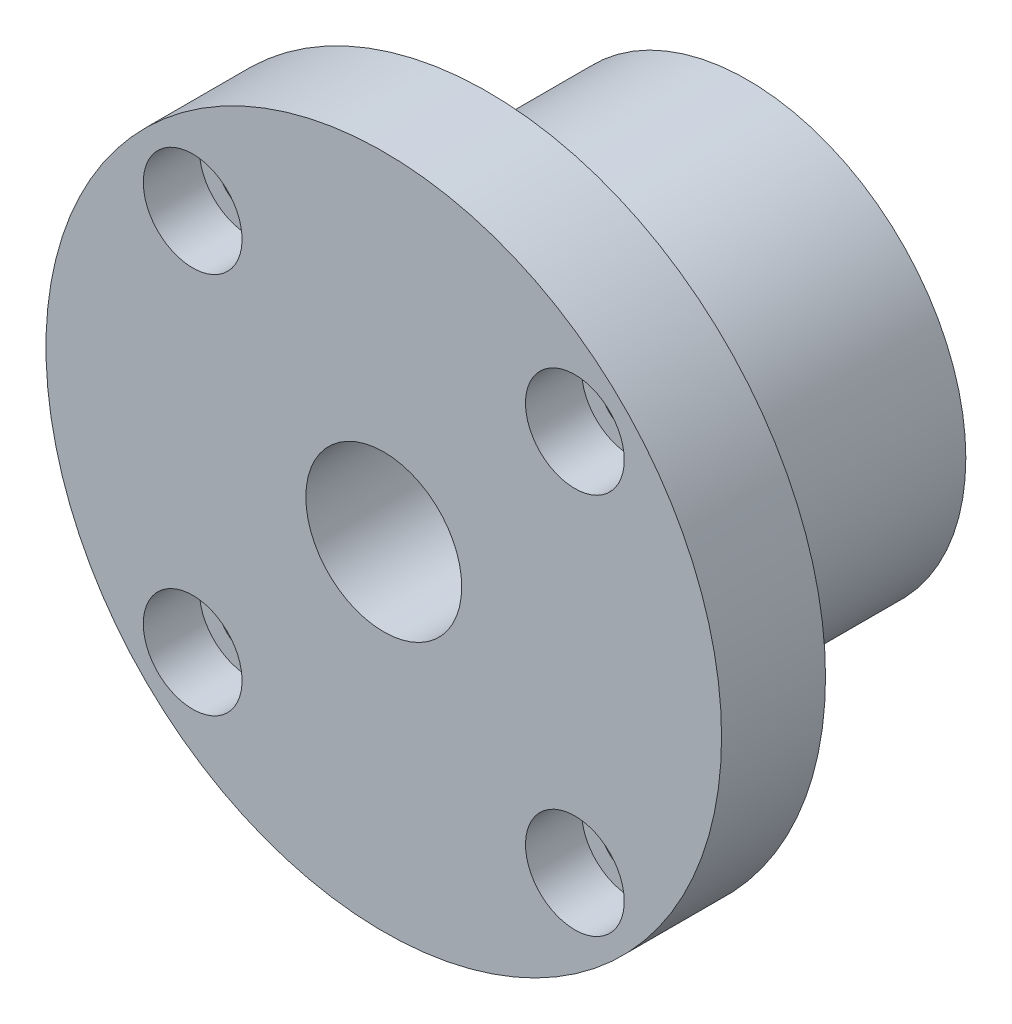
ISO-10303-21;
HEADER;
FILE_DESCRIPTION(('STEP AP214'),'2;1');
FILE_NAME('part.step','',(''),(''),'','','');
FILE_SCHEMA(('AUTOMOTIVE_DESIGN { 1 0 10303 214 1 1 1 1 }'));
ENDSEC;
DATA;
#1=APPLICATION_CONTEXT('core data for automotive mechanical design processes');
#2=APPLICATION_PROTOCOL_DEFINITION('international standard','automotive_design',2000,#1);
#3=PRODUCT_CONTEXT('',#1,'mechanical');
#4=PRODUCT('Part','Part','',(#3));
#5=PRODUCT_RELATED_PRODUCT_CATEGORY('part','',(#4));
#6=PRODUCT_DEFINITION_FORMATION('','',#4);
#7=PRODUCT_DEFINITION_CONTEXT('part definition',#1,'design');
#8=PRODUCT_DEFINITION('design','',#6,#7);
#9=PRODUCT_DEFINITION_SHAPE('','',#8);
#10=(LENGTH_UNIT() NAMED_UNIT(*) SI_UNIT(.MILLI.,.METRE.));
#11=(NAMED_UNIT(*) PLANE_ANGLE_UNIT() SI_UNIT($,.RADIAN.));
#12=(NAMED_UNIT(*) SI_UNIT($,.STERADIAN.) SOLID_ANGLE_UNIT());
#13=UNCERTAINTY_MEASURE_WITH_UNIT(LENGTH_MEASURE(1.E-05),#10,'distance_accuracy_value','');
#14=(GEOMETRIC_REPRESENTATION_CONTEXT(3) GLOBAL_UNCERTAINTY_ASSIGNED_CONTEXT((#13)) GLOBAL_UNIT_ASSIGNED_CONTEXT((#10,
#11,#12)) REPRESENTATION_CONTEXT('',''));
#15=CARTESIAN_POINT('',(0.,0.,0.));
#16=DIRECTION('',(0.,0.,1.));
#17=DIRECTION('',(1.,0.,0.));
#18=AXIS2_PLACEMENT_3D('',#15,#16,#17);
#19=CARTESIAN_POINT('',(0.,0.,0.));
#20=DIRECTION('',(0.,0.,1.));
#21=DIRECTION('',(1.,0.,0.));
#22=AXIS2_PLACEMENT_3D('',#19,#20,#21);
#23=PLANE('',#22);
#24=CARTESIAN_POINT('',(0.,0.,0.));
#25=DIRECTION('',(0.,0.,1.));
#26=DIRECTION('',(1.,0.,0.));
#27=AXIS2_PLACEMENT_3D('',#24,#25,#26);
#28=CIRCLE('',#27,32.5);
#29=CARTESIAN_POINT('',(32.5,0.,0.));
#30=VERTEX_POINT('',#29);
#31=EDGE_CURVE('E23',#30,#30,#28,.T.);
#32=ORIENTED_EDGE('',*,*,#31,.F.);
#33=EDGE_LOOP('',(#32));
#34=FACE_BOUND('',#33,.T.);
#35=CARTESIAN_POINT('',(18.3847763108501,18.3847763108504,0.));
#36=DIRECTION('',(0.,0.,1.));
#37=DIRECTION('',(1.,0.,0.));
#38=AXIS2_PLACEMENT_3D('',#35,#36,#37);
#39=CIRCLE('',#38,3.);
#40=CARTESIAN_POINT('',(21.3847763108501,18.3847763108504,0.));
#41=VERTEX_POINT('',#40);
#42=EDGE_CURVE('E35',#41,#41,#39,.T.);
#43=ORIENTED_EDGE('',*,*,#42,.T.);
#44=EDGE_LOOP('',(#43));
#45=FACE_BOUND('',#44,.T.);
#46=CARTESIAN_POINT('',(18.3847763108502,-18.3847763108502,0.));
#47=DIRECTION('',(0.,0.,1.));
#48=DIRECTION('',(0.,-1.,0.));
#49=AXIS2_PLACEMENT_3D('',#46,#47,#48);
#50=CIRCLE('',#49,3.);
#51=CARTESIAN_POINT('',(18.3847763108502,-21.3847763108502,0.));
#52=VERTEX_POINT('',#51);
#53=EDGE_CURVE('E75',#52,#52,#50,.T.);
#54=ORIENTED_EDGE('',*,*,#53,.T.);
#55=EDGE_LOOP('',(#54));
#56=FACE_BOUND('',#55,.T.);
#57=CARTESIAN_POINT('',(-18.3847763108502,-18.3847763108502,0.));
#58=DIRECTION('',(0.,0.,1.));
#59=DIRECTION('',(-1.,0.,0.));
#60=AXIS2_PLACEMENT_3D('',#57,#58,#59);
#61=CIRCLE('',#60,3.);
#62=CARTESIAN_POINT('',(-21.3847763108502,-18.3847763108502,0.));
#63=VERTEX_POINT('',#62);
#64=EDGE_CURVE('E72',#63,#63,#61,.T.);
#65=ORIENTED_EDGE('',*,*,#64,.T.);
#66=EDGE_LOOP('',(#65));
#67=FACE_BOUND('',#66,.T.);
#68=CARTESIAN_POINT('',(-18.3847763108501,18.3847763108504,0.));
#69=DIRECTION('',(0.,0.,1.));
#70=DIRECTION('',(0.,1.,0.));
#71=AXIS2_PLACEMENT_3D('',#68,#69,#70);
#72=CIRCLE('',#71,3.);
#73=CARTESIAN_POINT('',(-18.3847763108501,21.3847763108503,0.));
#74=VERTEX_POINT('',#73);
#75=EDGE_CURVE('E40',#74,#74,#72,.T.);
#76=ORIENTED_EDGE('',*,*,#75,.T.);
#77=EDGE_LOOP('',(#76));
#78=FACE_BOUND('',#77,.T.);
#79=CARTESIAN_POINT('',(0.,0.,0.));
#80=DIRECTION('',(0.,0.,1.));
#81=DIRECTION('',(1.,0.,0.));
#82=AXIS2_PLACEMENT_3D('',#79,#80,#81);
#83=CIRCLE('',#82,21.);
#84=CARTESIAN_POINT('',(21.,0.,0.));
#85=VERTEX_POINT('',#84);
#86=EDGE_CURVE('E8',#85,#85,#83,.F.);
#87=ORIENTED_EDGE('',*,*,#86,.F.);
#88=EDGE_LOOP('',(#87));
#89=FACE_BOUND('',#88,.T.);
#90=ADVANCED_FACE('F12',(#34,#45,#56,#67,#78,#89),#23,.F.);
#91=CARTESIAN_POINT('',(-18.3847763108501,18.3847763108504,0.));
#92=DIRECTION('',(0.,0.,1.));
#93=DIRECTION('',(1.,0.,0.));
#94=AXIS2_PLACEMENT_3D('',#91,#92,#93);
#95=CYLINDRICAL_SURFACE('',#94,3.);
#96=ORIENTED_EDGE('',*,*,#75,.F.);
#97=EDGE_LOOP('',(#96));
#98=FACE_BOUND('',#97,.T.);
#99=CARTESIAN_POINT('',(-18.3847763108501,18.3847763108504,4.6));
#100=DIRECTION('',(0.,0.,1.));
#101=DIRECTION('',(1.,0.,0.));
#102=AXIS2_PLACEMENT_3D('',#99,#100,#101);
#103=CIRCLE('',#102,3.);
#104=CARTESIAN_POINT('',(-15.3847763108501,18.3847763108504,4.6));
#105=VERTEX_POINT('',#104);
#106=EDGE_CURVE('E46',#105,#105,#103,.F.);
#107=ORIENTED_EDGE('',*,*,#106,.F.);
#108=EDGE_LOOP('',(#107));
#109=FACE_BOUND('',#108,.T.);
#110=ADVANCED_FACE('F120',(#98,#109),#95,.F.);
#111=CARTESIAN_POINT('',(-18.3847763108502,-18.3847763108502,0.));
#112=DIRECTION('',(0.,0.,1.));
#113=DIRECTION('',(1.,0.,0.));
#114=AXIS2_PLACEMENT_3D('',#111,#112,#113);
#115=CYLINDRICAL_SURFACE('',#114,3.);
#116=ORIENTED_EDGE('',*,*,#64,.F.);
#117=EDGE_LOOP('',(#116));
#118=FACE_BOUND('',#117,.T.);
#119=CARTESIAN_POINT('',(-18.3847763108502,-18.3847763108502,4.6));
#120=DIRECTION('',(0.,0.,1.));
#121=DIRECTION('',(1.,0.,0.));
#122=AXIS2_PLACEMENT_3D('',#119,#120,#121);
#123=CIRCLE('',#122,3.);
#124=CARTESIAN_POINT('',(-15.3847763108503,-18.3847763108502,4.6));
#125=VERTEX_POINT('',#124);
#126=EDGE_CURVE('E42',#125,#125,#123,.F.);
#127=ORIENTED_EDGE('',*,*,#126,.F.);
#128=EDGE_LOOP('',(#127));
#129=FACE_BOUND('',#128,.T.);
#130=ADVANCED_FACE('F126',(#118,#129),#115,.F.);
#131=CARTESIAN_POINT('',(18.3847763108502,-18.3847763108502,0.));
#132=DIRECTION('',(0.,0.,1.));
#133=DIRECTION('',(1.,0.,0.));
#134=AXIS2_PLACEMENT_3D('',#131,#132,#133);
#135=CYLINDRICAL_SURFACE('',#134,3.);
#136=ORIENTED_EDGE('',*,*,#53,.F.);
#137=EDGE_LOOP('',(#136));
#138=FACE_BOUND('',#137,.T.);
#139=CARTESIAN_POINT('',(18.3847763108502,-18.3847763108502,4.6));
#140=DIRECTION('',(0.,0.,1.));
#141=DIRECTION('',(1.,0.,0.));
#142=AXIS2_PLACEMENT_3D('',#139,#140,#141);
#143=CIRCLE('',#142,3.);
#144=CARTESIAN_POINT('',(21.3847763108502,-18.3847763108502,4.6));
#145=VERTEX_POINT('',#144);
#146=EDGE_CURVE('E37',#145,#145,#143,.F.);
#147=ORIENTED_EDGE('',*,*,#146,.F.);
#148=EDGE_LOOP('',(#147));
#149=FACE_BOUND('',#148,.T.);
#150=ADVANCED_FACE('F137',(#138,#149),#135,.F.);
#151=CARTESIAN_POINT('',(18.3847763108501,18.3847763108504,0.));
#152=DIRECTION('',(0.,0.,1.));
#153=DIRECTION('',(1.,0.,0.));
#154=AXIS2_PLACEMENT_3D('',#151,#152,#153);
#155=CYLINDRICAL_SURFACE('',#154,3.);
#156=ORIENTED_EDGE('',*,*,#42,.F.);
#157=EDGE_LOOP('',(#156));
#158=FACE_BOUND('',#157,.T.);
#159=CARTESIAN_POINT('',(18.3847763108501,18.3847763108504,4.6));
#160=DIRECTION('',(0.,0.,1.));
#161=DIRECTION('',(1.,0.,0.));
#162=AXIS2_PLACEMENT_3D('',#159,#160,#161);
#163=CIRCLE('',#162,3.);
#164=CARTESIAN_POINT('',(21.3847763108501,18.3847763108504,4.6));
#165=VERTEX_POINT('',#164);
#166=EDGE_CURVE('E32',#165,#165,#163,.F.);
#167=ORIENTED_EDGE('',*,*,#166,.F.);
#168=EDGE_LOOP('',(#167));
#169=FACE_BOUND('',#168,.T.);
#170=ADVANCED_FACE('F92',(#158,#169),#155,.F.);
#171=CARTESIAN_POINT('',(0.,0.,10.));
#172=DIRECTION('',(0.,0.,1.));
#173=DIRECTION('',(1.,0.,0.));
#174=AXIS2_PLACEMENT_3D('',#171,#172,#173);
#175=PLANE('',#174);
#176=CARTESIAN_POINT('',(0.,0.,10.));
#177=DIRECTION('',(0.,0.,1.));
#178=DIRECTION('',(1.,0.,0.));
#179=AXIS2_PLACEMENT_3D('',#176,#177,#178);
#180=CIRCLE('',#179,7.5);
#181=CARTESIAN_POINT('',(7.5,0.,10.));
#182=VERTEX_POINT('',#181);
#183=EDGE_CURVE('E28',#182,#182,#180,.T.);
#184=ORIENTED_EDGE('',*,*,#183,.F.);
#185=EDGE_LOOP('',(#184));
#186=FACE_BOUND('',#185,.T.);
#187=CARTESIAN_POINT('',(0.,0.,10.));
#188=DIRECTION('',(0.,0.,1.));
#189=DIRECTION('',(1.,0.,0.));
#190=AXIS2_PLACEMENT_3D('',#187,#188,#189);
#191=CIRCLE('',#190,32.5);
#192=CARTESIAN_POINT('',(32.5,0.,10.));
#193=VERTEX_POINT('',#192);
#194=EDGE_CURVE('E19',#193,#193,#191,.T.);
#195=ORIENTED_EDGE('',*,*,#194,.T.);
#196=EDGE_LOOP('',(#195));
#197=FACE_BOUND('',#196,.T.);
#198=CARTESIAN_POINT('',(18.3847763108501,18.3847763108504,10.));
#199=DIRECTION('',(0.,0.,1.));
#200=DIRECTION('',(1.,0.,0.));
#201=AXIS2_PLACEMENT_3D('',#198,#199,#200);
#202=CIRCLE('',#201,4.75);
#203=CARTESIAN_POINT('',(23.1347763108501,18.3847763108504,10.));
#204=VERTEX_POINT('',#203);
#205=EDGE_CURVE('E78',#204,#204,#202,.T.);
#206=ORIENTED_EDGE('',*,*,#205,.F.);
#207=EDGE_LOOP('',(#206));
#208=FACE_BOUND('',#207,.T.);
#209=CARTESIAN_POINT('',(18.3847763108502,-18.3847763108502,10.));
#210=DIRECTION('',(0.,0.,1.));
#211=DIRECTION('',(0.,-1.,0.));
#212=AXIS2_PLACEMENT_3D('',#209,#210,#211);
#213=CIRCLE('',#212,4.75);
#214=CARTESIAN_POINT('',(18.3847763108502,-23.1347763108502,10.));
#215=VERTEX_POINT('',#214);
#216=EDGE_CURVE('E44',#215,#215,#213,.T.);
#217=ORIENTED_EDGE('',*,*,#216,.F.);
#218=EDGE_LOOP('',(#217));
#219=FACE_BOUND('',#218,.T.);
#220=CARTESIAN_POINT('',(-18.3847763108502,-18.3847763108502,10.));
#221=DIRECTION('',(0.,0.,1.));
#222=DIRECTION('',(-1.,0.,0.));
#223=AXIS2_PLACEMENT_3D('',#220,#221,#222);
#224=CIRCLE('',#223,4.75);
#225=CARTESIAN_POINT('',(-23.1347763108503,-18.3847763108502,10.));
#226=VERTEX_POINT('',#225);
#227=EDGE_CURVE('E48',#226,#226,#224,.T.);
#228=ORIENTED_EDGE('',*,*,#227,.F.);
#229=EDGE_LOOP('',(#228));
#230=FACE_BOUND('',#229,.T.);
#231=CARTESIAN_POINT('',(-18.3847763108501,18.3847763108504,10.));
#232=DIRECTION('',(0.,0.,1.));
#233=DIRECTION('',(0.,1.,0.));
#234=AXIS2_PLACEMENT_3D('',#231,#232,#233);
#235=CIRCLE('',#234,4.75);
#236=CARTESIAN_POINT('',(-18.3847763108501,23.1347763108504,10.));
#237=VERTEX_POINT('',#236);
#238=EDGE_CURVE('E55',#237,#237,#235,.T.);
#239=ORIENTED_EDGE('',*,*,#238,.F.);
#240=EDGE_LOOP('',(#239));
#241=FACE_BOUND('',#240,.T.);
#242=ADVANCED_FACE('F90',(#186,#197,#208,#219,#230,#241),#175,.T.);
#243=CARTESIAN_POINT('',(0.,0.,10.));
#244=DIRECTION('',(0.,0.,-1.));
#245=DIRECTION('',(-1.,0.,0.));
#246=AXIS2_PLACEMENT_3D('',#243,#244,#245);
#247=CYLINDRICAL_SURFACE('',#246,32.5);
#248=ORIENTED_EDGE('',*,*,#194,.F.);
#249=EDGE_LOOP('',(#248));
#250=FACE_BOUND('',#249,.T.);
#251=ORIENTED_EDGE('',*,*,#31,.T.);
#252=EDGE_LOOP('',(#251));
#253=FACE_BOUND('',#252,.T.);
#254=ADVANCED_FACE('F14',(#250,#253),#247,.T.);
#255=CARTESIAN_POINT('',(0.,0.,10.));
#256=DIRECTION('',(0.,0.,-1.));
#257=DIRECTION('',(-1.,0.,0.));
#258=AXIS2_PLACEMENT_3D('',#255,#256,#257);
#259=CYLINDRICAL_SURFACE('',#258,7.5);
#260=ORIENTED_EDGE('',*,*,#183,.T.);
#261=EDGE_LOOP('',(#260));
#262=FACE_BOUND('',#261,.T.);
#263=CARTESIAN_POINT('',(0.,0.,-25.));
#264=DIRECTION('',(0.,0.,-1.));
#265=DIRECTION('',(-1.,0.,0.));
#266=AXIS2_PLACEMENT_3D('',#263,#264,#265);
#267=CIRCLE('',#266,7.5);
#268=CARTESIAN_POINT('',(-7.5,0.,-25.));
#269=VERTEX_POINT('',#268);
#270=EDGE_CURVE('E292',#269,#269,#267,.T.);
#271=ORIENTED_EDGE('',*,*,#270,.T.);
#272=EDGE_LOOP('',(#271));
#273=FACE_BOUND('',#272,.T.);
#274=ADVANCED_FACE('F87',(#262,#273),#259,.F.);
#275=CARTESIAN_POINT('',(18.3847763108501,18.3847763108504,4.6));
#276=DIRECTION('',(0.,0.,1.));
#277=DIRECTION('',(1.,0.,0.));
#278=AXIS2_PLACEMENT_3D('',#275,#276,#277);
#279=PLANE('',#278);
#280=CARTESIAN_POINT('',(18.3847763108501,18.3847763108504,4.6));
#281=DIRECTION('',(0.,0.,1.));
#282=DIRECTION('',(1.,0.,0.));
#283=AXIS2_PLACEMENT_3D('',#280,#281,#282);
#284=CIRCLE('',#283,4.75);
#285=CARTESIAN_POINT('',(23.1347763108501,18.3847763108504,4.6));
#286=VERTEX_POINT('',#285);
#287=EDGE_CURVE('E36',#286,#286,#284,.T.);
#288=ORIENTED_EDGE('',*,*,#287,.T.);
#289=EDGE_LOOP('',(#288));
#290=FACE_BOUND('',#289,.T.);
#291=ORIENTED_EDGE('',*,*,#166,.T.);
#292=EDGE_LOOP('',(#291));
#293=FACE_BOUND('',#292,.T.);
#294=ADVANCED_FACE('F134',(#290,#293),#279,.T.);
#295=CARTESIAN_POINT('',(18.3847763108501,18.3847763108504,4.6));
#296=DIRECTION('',(0.,0.,1.));
#297=DIRECTION('',(1.,0.,0.));
#298=AXIS2_PLACEMENT_3D('',#295,#296,#297);
#299=CYLINDRICAL_SURFACE('',#298,4.75);
#300=ORIENTED_EDGE('',*,*,#287,.F.);
#301=EDGE_LOOP('',(#300));
#302=FACE_BOUND('',#301,.T.);
#303=ORIENTED_EDGE('',*,*,#205,.T.);
#304=EDGE_LOOP('',(#303));
#305=FACE_BOUND('',#304,.T.);
#306=ADVANCED_FACE('F139',(#302,#305),#299,.F.);
#307=CARTESIAN_POINT('',(18.3847763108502,-18.3847763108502,4.6));
#308=DIRECTION('',(0.,0.,1.));
#309=DIRECTION('',(0.,-1.,0.));
#310=AXIS2_PLACEMENT_3D('',#307,#308,#309);
#311=PLANE('',#310);
#312=CARTESIAN_POINT('',(18.3847763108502,-18.3847763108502,4.6));
#313=DIRECTION('',(0.,0.,1.));
#314=DIRECTION('',(0.,-1.,0.));
#315=AXIS2_PLACEMENT_3D('',#312,#313,#314);
#316=CIRCLE('',#315,4.75);
#317=CARTESIAN_POINT('',(18.3847763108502,-23.1347763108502,4.6));
#318=VERTEX_POINT('',#317);
#319=EDGE_CURVE('E41',#318,#318,#316,.T.);
#320=ORIENTED_EDGE('',*,*,#319,.T.);
#321=EDGE_LOOP('',(#320));
#322=FACE_BOUND('',#321,.T.);
#323=ORIENTED_EDGE('',*,*,#146,.T.);
#324=EDGE_LOOP('',(#323));
#325=FACE_BOUND('',#324,.T.);
#326=ADVANCED_FACE('F142',(#322,#325),#311,.T.);
#327=CARTESIAN_POINT('',(18.3847763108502,-18.3847763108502,4.6));
#328=DIRECTION('',(0.,0.,1.));
#329=DIRECTION('',(1.,0.,0.));
#330=AXIS2_PLACEMENT_3D('',#327,#328,#329);
#331=CYLINDRICAL_SURFACE('',#330,4.75);
#332=ORIENTED_EDGE('',*,*,#319,.F.);
#333=EDGE_LOOP('',(#332));
#334=FACE_BOUND('',#333,.T.);
#335=ORIENTED_EDGE('',*,*,#216,.T.);
#336=EDGE_LOOP('',(#335));
#337=FACE_BOUND('',#336,.T.);
#338=ADVANCED_FACE('F153',(#334,#337),#331,.F.);
#339=CARTESIAN_POINT('',(-18.3847763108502,-18.3847763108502,4.6));
#340=DIRECTION('',(0.,0.,1.));
#341=DIRECTION('',(-1.,0.,0.));
#342=AXIS2_PLACEMENT_3D('',#339,#340,#341);
#343=PLANE('',#342);
#344=CARTESIAN_POINT('',(-18.3847763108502,-18.3847763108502,4.6));
#345=DIRECTION('',(0.,0.,1.));
#346=DIRECTION('',(-1.,0.,0.));
#347=AXIS2_PLACEMENT_3D('',#344,#345,#346);
#348=CIRCLE('',#347,4.75);
#349=CARTESIAN_POINT('',(-23.1347763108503,-18.3847763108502,4.6));
#350=VERTEX_POINT('',#349);
#351=EDGE_CURVE('E45',#350,#350,#348,.T.);
#352=ORIENTED_EDGE('',*,*,#351,.T.);
#353=EDGE_LOOP('',(#352));
#354=FACE_BOUND('',#353,.T.);
#355=ORIENTED_EDGE('',*,*,#126,.T.);
#356=EDGE_LOOP('',(#355));
#357=FACE_BOUND('',#356,.T.);
#358=ADVANCED_FACE('F156',(#354,#357),#343,.T.);
#359=CARTESIAN_POINT('',(-18.3847763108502,-18.3847763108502,4.6));
#360=DIRECTION('',(0.,0.,1.));
#361=DIRECTION('',(1.,0.,0.));
#362=AXIS2_PLACEMENT_3D('',#359,#360,#361);
#363=CYLINDRICAL_SURFACE('',#362,4.75);
#364=ORIENTED_EDGE('',*,*,#351,.F.);
#365=EDGE_LOOP('',(#364));
#366=FACE_BOUND('',#365,.T.);
#367=ORIENTED_EDGE('',*,*,#227,.T.);
#368=EDGE_LOOP('',(#367));
#369=FACE_BOUND('',#368,.T.);
#370=ADVANCED_FACE('F116',(#366,#369),#363,.F.);
#371=CARTESIAN_POINT('',(-18.3847763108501,18.3847763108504,4.6));
#372=DIRECTION('',(0.,0.,1.));
#373=DIRECTION('',(0.,1.,0.));
#374=AXIS2_PLACEMENT_3D('',#371,#372,#373);
#375=PLANE('',#374);
#376=CARTESIAN_POINT('',(-18.3847763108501,18.3847763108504,4.6));
#377=DIRECTION('',(0.,0.,1.));
#378=DIRECTION('',(0.,1.,0.));
#379=AXIS2_PLACEMENT_3D('',#376,#377,#378);
#380=CIRCLE('',#379,4.75);
#381=CARTESIAN_POINT('',(-18.3847763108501,23.1347763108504,4.6));
#382=VERTEX_POINT('',#381);
#383=EDGE_CURVE('E49',#382,#382,#380,.T.);
#384=ORIENTED_EDGE('',*,*,#383,.T.);
#385=EDGE_LOOP('',(#384));
#386=FACE_BOUND('',#385,.T.);
#387=ORIENTED_EDGE('',*,*,#106,.T.);
#388=EDGE_LOOP('',(#387));
#389=FACE_BOUND('',#388,.T.);
#390=ADVANCED_FACE('F105',(#386,#389),#375,.T.);
#391=CARTESIAN_POINT('',(-18.3847763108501,18.3847763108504,4.6));
#392=DIRECTION('',(0.,0.,1.));
#393=DIRECTION('',(1.,0.,0.));
#394=AXIS2_PLACEMENT_3D('',#391,#392,#393);
#395=CYLINDRICAL_SURFACE('',#394,4.75);
#396=ORIENTED_EDGE('',*,*,#383,.F.);
#397=EDGE_LOOP('',(#396));
#398=FACE_BOUND('',#397,.T.);
#399=ORIENTED_EDGE('',*,*,#238,.T.);
#400=EDGE_LOOP('',(#399));
#401=FACE_BOUND('',#400,.T.);
#402=ADVANCED_FACE('F102',(#398,#401),#395,.F.);
#403=CARTESIAN_POINT('',(0.,0.,-25.));
#404=DIRECTION('',(0.,0.,1.));
#405=DIRECTION('',(1.,0.,0.));
#406=AXIS2_PLACEMENT_3D('',#403,#404,#405);
#407=CYLINDRICAL_SURFACE('',#406,21.);
#408=CARTESIAN_POINT('',(0.,0.,-25.));
#409=DIRECTION('',(0.,0.,-1.));
#410=DIRECTION('',(-1.,0.,0.));
#411=AXIS2_PLACEMENT_3D('',#408,#409,#410);
#412=CIRCLE('',#411,21.);
#413=CARTESIAN_POINT('',(-21.,0.,-25.));
#414=VERTEX_POINT('',#413);
#415=EDGE_CURVE('E60',#414,#414,#412,.T.);
#416=ORIENTED_EDGE('',*,*,#415,.F.);
#417=EDGE_LOOP('',(#416));
#418=FACE_BOUND('',#417,.T.);
#419=ORIENTED_EDGE('',*,*,#86,.T.);
#420=EDGE_LOOP('',(#419));
#421=FACE_BOUND('',#420,.T.);
#422=ADVANCED_FACE('F104',(#418,#421),#407,.T.);
#423=CARTESIAN_POINT('',(0.,0.,-25.));
#424=DIRECTION('',(0.,0.,-1.));
#425=DIRECTION('',(-1.,0.,0.));
#426=AXIS2_PLACEMENT_3D('',#423,#424,#425);
#427=PLANE('',#426);
#428=ORIENTED_EDGE('',*,*,#415,.T.);
#429=EDGE_LOOP('',(#428));
#430=FACE_BOUND('',#429,.T.);
#431=ORIENTED_EDGE('',*,*,#270,.F.);
#432=EDGE_LOOP('',(#431));
#433=FACE_BOUND('',#432,.T.);
#434=ADVANCED_FACE('F113',(#430,#433),#427,.T.);
#435=CLOSED_SHELL('',(#90,#110,#130,#150,#170,#242,#254,#274,#294,#306,#326,#338,#358,#370,#390,
#402,#422,#434));
#436=MANIFOLD_SOLID_BREP('B1',#435);
#437=ADVANCED_BREP_SHAPE_REPRESENTATION('',(#18,#436),#14);
#438=SHAPE_DEFINITION_REPRESENTATION(#9,#437);
ENDSEC;
END-ISO-10303-21;
